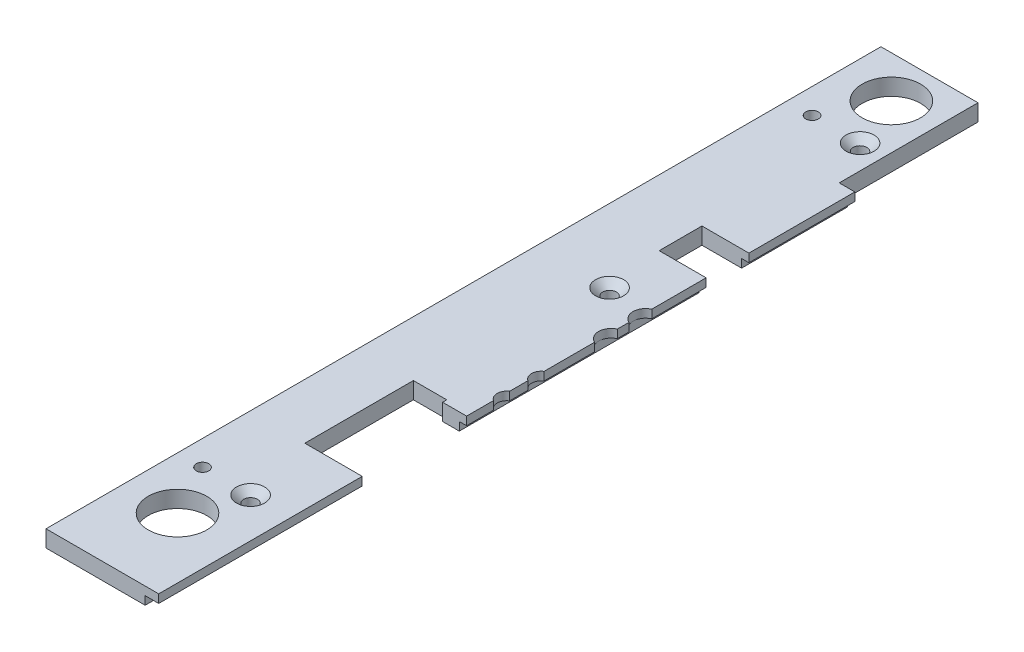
from build123d import *

# Parameters (mm, degrees)
ESQUISSE1_W                                      = 54
ESQUISSE1_H                                      = 8
BASE_EXTRUSION_DEPTH                             = 400
ESQUISSE3_R                                      = 4.6
ESQUISSE3_R_2                                    = 6
ESQUISSE3_W                                      = 22.5
ESQUISSE3_H                                      = 20.5
ESQUISSE3_W_2                                    = 7.5
ESQUISSE3_H_2                                    = 66.492944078
ENL_V_MAT_EXTRU_1_DEPTH                          = 404.707815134
ENL_V_MAT_EXTRU_2_REACH                          = 405.708
ESQUISSE4_W                                      = 6.5
ESQUISSE4_H                                      = 4
ESQUISSE5_W                                      = 3.5
ESQUISSE5_H                                      = 4
ENL_V_MAT_EXTRU_3_DEPTH                          = 259.33360215
ESQUISSE6_R                                      = 14
ENL_V_MAT_EXTRU_4_DEPTH                          = 404.707815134
FRAISAGE_POUR_VIS_T_TE_FRAIS_E_6_PAN_D           = 6.6
FRAISAGE_POUR_VIS_T_TE_FRAIS_E_6_PAN_CSINK_D     = 13.44
FRAISAGE_POUR_VIS_T_TE_FRAIS_E_6_PAN_CSINK_ANGLE = 90
ESQUISSE9_R                                      = 3
ENL_V_MAT_EXTRU_5_DEPTH                          = 404.707815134


with BuildPart() as part:
    # Esquisse1 → Base-Extrusion (new body)
    with BuildSketch(Plane.XY):
        with Locations((27, 4)):
            Rectangle(ESQUISSE1_W, ESQUISSE1_H)
    extrude(amount=BASE_EXTRUSION_DEPTH)

    # Esquisse3 → Enl_v. mat.-Extru.1 (cut, through all)
    with BuildSketch(Plane(origin=(0, 8, 0), x_dir=(-1, 0, 0), z_dir=(0, 1, 0))):
        with Locations((-56.5, 235.75)):
            Circle(ESQUISSE3_R)
        with Locations((-56.5, 219.25)):
            Circle(ESQUISSE3_R)
        with Locations((-56.5, 185.75)):
            Circle(ESQUISSE3_R_2)
        with Locations((-56.5, 169.25)):
            Circle(ESQUISSE3_R_2)
        Polygon((-42.5, 252.5), (-61.049289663, 252.5), (-61.049289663, 302.5), (-26.5, 302.5), (-26.5, 250.5), (-42.5, 250.5), align=None)
        with Locations((-42.75, 127.5)):
            Rectangle(ESQUISSE3_W, ESQUISSE3_H)
        with Locations((-50.25, 33.246472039)):
            Rectangle(ESQUISSE3_W_2, ESQUISSE3_H_2)
    extrude(amount=-ENL_V_MAT_EXTRU_1_DEPTH, mode=Mode.SUBTRACT)

    # Esquisse4 → Enl_v. mat.-Extru.2 (cut, up to next)
    with BuildSketch(Plane.XY.offset(400), mode=Mode.PRIVATE) as enl_v_mat_extru_2_sk1:
        with Locations((50.75, 2)):
            Rectangle(ESQUISSE4_W, ESQUISSE4_H)
    enl_v_mat_extru_2_tool1 = extrude(enl_v_mat_extru_2_sk1.sketch, amount=-ENL_V_MAT_EXTRU_2_REACH, mode=Mode.PRIVATE) & part.part
    add(enl_v_mat_extru_2_tool1.solids().sort_by_distance((50.75, 2, 400))[0], mode=Mode.SUBTRACT)

    # Esquisse5 → Enl_v. mat.-Extru.3 (cut, through all)
    with BuildSketch(Plane.XY.offset(252.5)):
        with Locations((52.25, 2)):
            Rectangle(ESQUISSE5_W, ESQUISSE5_H)
    extrude(amount=-ENL_V_MAT_EXTRU_3_DEPTH, mode=Mode.SUBTRACT)

    # Esquisse6 → Enl_v. mat.-Extru.4 (cut, through all)
    with BuildSketch(Plane(origin=(0, 8, 0), x_dir=(-1, 0, 0), z_dir=(0, 1, 0))):
        with Locations((-25, 20)):
            Circle(ESQUISSE6_R)
        with Locations((-25, 362)):
            Circle(ESQUISSE6_R)
    extrude(amount=-ENL_V_MAT_EXTRU_4_DEPTH, mode=Mode.SUBTRACT)

    # Fraisage pour vis _ t_te frais_e _ 6 pan (through all)
    with Locations(Plane(origin=(0, 8, 0), x_dir=(-1, 0, 0), z_dir=(0, 1, 0))):
        with Locations((-35, 45), (-35, 337), (-35, 165)):
            CounterSinkHole(FRAISAGE_POUR_VIS_T_TE_FRAIS_E_6_PAN_D / 2, FRAISAGE_POUR_VIS_T_TE_FRAIS_E_6_PAN_CSINK_D / 2, counter_sink_angle=FRAISAGE_POUR_VIS_T_TE_FRAIS_E_6_PAN_CSINK_ANGLE)

    # Esquisse9 → Enl_v. mat.-Extru.5 (cut, through all)
    with BuildSketch(Plane(origin=(0, 8, 0), x_dir=(-1, 0, 0), z_dir=(0, 1, 0))):
        with Locations((-12, 337)):
            Circle(ESQUISSE9_R)
        with Locations((-12, 45)):
            Circle(ESQUISSE9_R)
    extrude(amount=-ENL_V_MAT_EXTRU_5_DEPTH, mode=Mode.SUBTRACT)


solid = part.part
